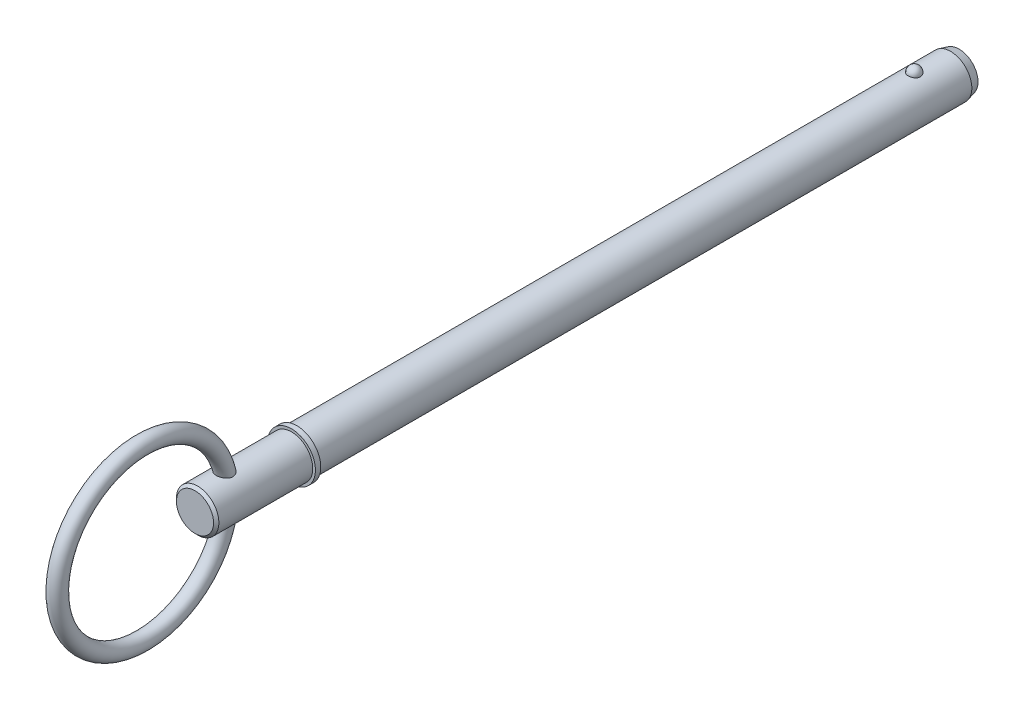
from build123d import *

# Parameters (mm, degrees)
SKETCH2_R           = 3.97
BOSS_EXTRUDE1_DEPTH = 114.3
BOSS_EXTRUDE2_START = 9.53
SKETCH3_R           = 3.97
BOSS_EXTRUDE2_DEPTH = 9.53
CHAMFER1_SIZE       = 1.586
CHAMFER1_SIZE2      = 0.424967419
SKETCH20_W          = 1
SKETCH20_H          = 4.47
SKETCH21_R          = 3.97
BOSS_EXTRUDE3_DEPTH = 19.05
CHAMFER2_SIZE       = 0.5
SKETCH24_R          = 1.5


with BuildPart() as part:
    # Sketch2 → Boss-Extrude1 (new body)
    with BuildSketch(Plane.XY):
        Circle(SKETCH2_R)
    extrude(amount=BOSS_EXTRUDE1_DEPTH)

    # Sketch3 → Boss-Extrude2 (add)
    with BuildSketch(Plane(origin=(0, 0, 0), x_dir=(-1, 0, 0), z_dir=(0, 0, -1)).offset(BOSS_EXTRUDE2_START)):
        Circle(SKETCH3_R)
    extrude(amount=-BOSS_EXTRUDE2_DEPTH)

    # Chamfer1
    chamfer1_edges = [part.edges().sort_by_distance(p)[0] for p in [
        (3.97, 0, -9.53),
    ]]
    chamfer1_side = [part.faces().sort_by_distance(p)[0] for p in [
        (3.97, 0, -4.765),
    ]]
    chamfer(chamfer1_edges, length=CHAMFER1_SIZE, length2=CHAMFER1_SIZE2, reference=chamfer1_side[0])

    # Sketch18 → Revolve1 (revolve)
    with BuildSketch(Plane(origin=(0, 0, 0), x_dir=(0, 0, -1), z_dir=(1, 0, 0))):
        with BuildLine():
            Line((1.15, 5.12), (1.15, 2.82))
            ThreePointArc((1.15, 2.82), (0, 3.97), (1.15, 5.12))
        make_face()
    revolve(axis=Axis((0, 5.12, -1.15), (0, -1, 0)))

    # Sketch20 → Revolve2 (revolve)
    with BuildSketch(Plane(origin=(0, 0, 0), x_dir=(0, 0, -1), z_dir=(1, 0, 0)), mode=Mode.PRIVATE) as revolve2_sk:
        with Locations((-114.8, 2.235)):
            Rectangle(SKETCH20_W, SKETCH20_H)
    revolve(revolve2_sk.sketch.rotate(Axis((0, 0, 33.728787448), (0, 0, 1)), 90), axis=Axis((0, 0, 33.728787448), (0, 0, 1)))

    # Sketch21 → Boss-Extrude3 (add)
    with BuildSketch(Plane(origin=(0, 0, 114.3), x_dir=(-1, 0, 0), z_dir=(0, 0, -1))):
        Circle(SKETCH21_R)
    extrude(amount=-BOSS_EXTRUDE3_DEPTH)

    # Chamfer2
    chamfer2_edges = [part.edges().sort_by_distance(p)[0] for p in [
        (3.97, 0, 133.35),
    ]]
    chamfer(chamfer2_edges, length=CHAMFER2_SIZE)

    # Sweep1: sweep along a path in Sketch23
    with BuildLine(Plane(origin=(0, 0, 0), x_dir=(0, 0, -1), z_dir=(1, 0, 0))) as sweep1_path:
        CenterArc((-143.225, 0), 15.875, 0, 360)
    # Sketch24 → Sweep1 (sweep)
    with BuildSketch(Plane(origin=(0, 0, 0), x_dir=(1, 0, 0), z_dir=(0, 1, 0))):
        with Locations((0, -127.35)):
            Circle(SKETCH24_R)
    sweep(path=sweep1_path.line)


solid = part.part
